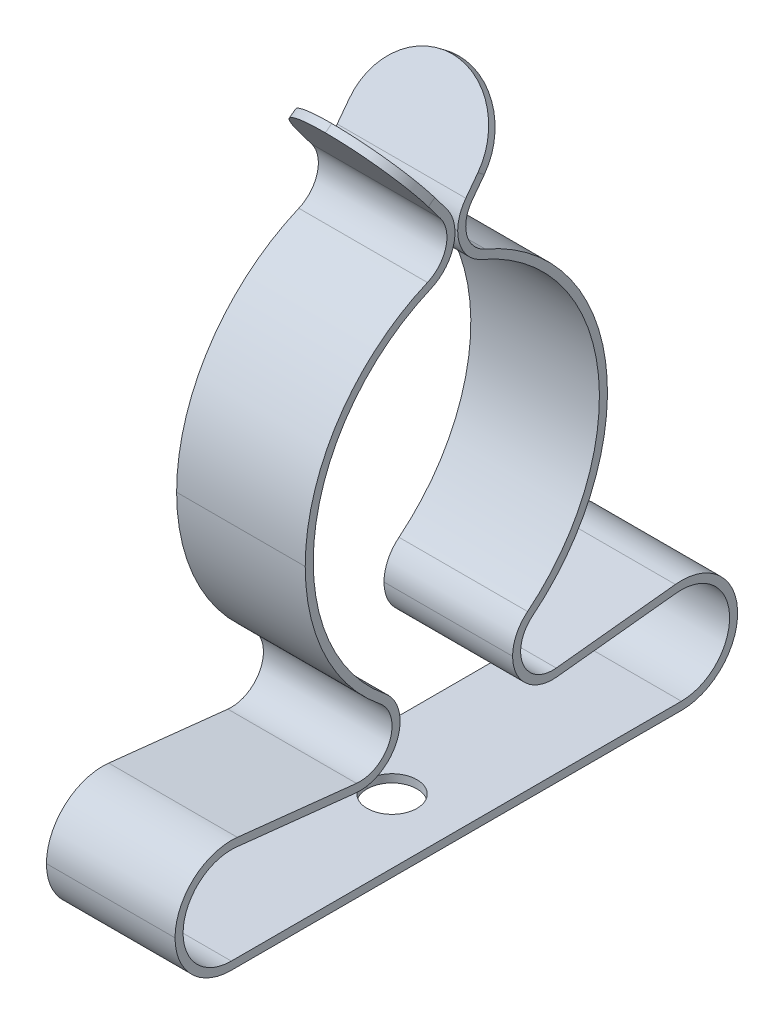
ISO-10303-21;
HEADER;
FILE_DESCRIPTION(('STEP AP214'),'2;1');
FILE_NAME('part.step','',(''),(''),'','','');
FILE_SCHEMA(('AUTOMOTIVE_DESIGN { 1 0 10303 214 1 1 1 1 }'));
ENDSEC;
DATA;
#1=APPLICATION_CONTEXT('core data for automotive mechanical design processes');
#2=APPLICATION_PROTOCOL_DEFINITION('international standard','automotive_design',2000,#1);
#3=PRODUCT_CONTEXT('',#1,'mechanical');
#4=PRODUCT('Part','Part','',(#3));
#5=PRODUCT_RELATED_PRODUCT_CATEGORY('part','',(#4));
#6=PRODUCT_DEFINITION_FORMATION('','',#4);
#7=PRODUCT_DEFINITION_CONTEXT('part definition',#1,'design');
#8=PRODUCT_DEFINITION('design','',#6,#7);
#9=PRODUCT_DEFINITION_SHAPE('','',#8);
#10=(LENGTH_UNIT() NAMED_UNIT(*) SI_UNIT(.MILLI.,.METRE.));
#11=(NAMED_UNIT(*) PLANE_ANGLE_UNIT() SI_UNIT($,.RADIAN.));
#12=(NAMED_UNIT(*) SI_UNIT($,.STERADIAN.) SOLID_ANGLE_UNIT());
#13=UNCERTAINTY_MEASURE_WITH_UNIT(LENGTH_MEASURE(1.E-05),#10,'distance_accuracy_value','');
#14=(GEOMETRIC_REPRESENTATION_CONTEXT(3) GLOBAL_UNCERTAINTY_ASSIGNED_CONTEXT((#13)) GLOBAL_UNIT_ASSIGNED_CONTEXT((#10,
#11,#12)) REPRESENTATION_CONTEXT('',''));
#15=CARTESIAN_POINT('',(0.,0.,0.));
#16=DIRECTION('',(0.,0.,1.));
#17=DIRECTION('',(1.,0.,0.));
#18=AXIS2_PLACEMENT_3D('',#15,#16,#17);
#19=CARTESIAN_POINT('',(0.,43.1009588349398,3.66111084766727));
#20=DIRECTION('',(0.,-0.601889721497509,-0.798579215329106));
#21=DIRECTION('',(0.,0.798579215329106,-0.601889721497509));
#22=AXIS2_PLACEMENT_3D('',#19,#20,#21);
#23=CYLINDRICAL_SURFACE('',#22,4.);
#24=CARTESIAN_POINT('',(0.,44.6056831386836,5.65755888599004));
#25=DIRECTION('',(0.,0.601889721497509,0.798579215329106));
#26=DIRECTION('',(0.,-0.798579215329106,0.601889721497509));
#27=AXIS2_PLACEMENT_3D('',#24,#25,#26);
#28=CIRCLE('',#27,4.);
#29=CARTESIAN_POINT('',(0.,47.8,3.25));
#30=VERTEX_POINT('',#29);
#31=CARTESIAN_POINT('',(-4.,44.6056831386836,5.65755888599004));
#32=VERTEX_POINT('',#31);
#33=EDGE_CURVE('E593',#30,#32,#28,.T.);
#34=ORIENTED_EDGE('',*,*,#33,.F.);
#35=DIRECTION('',(0.,-0.601889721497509,-0.798579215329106));
#36=VECTOR('',#35,1.);
#37=CARTESIAN_POINT('',(0.,47.4990551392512,2.85071039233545));
#38=LINE('',#37,#36);
#39=CARTESIAN_POINT('',(0.,47.4990551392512,2.85071039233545));
#40=VERTEX_POINT('',#39);
#41=EDGE_CURVE('E11',#30,#40,#38,.T.);
#42=ORIENTED_EDGE('',*,*,#41,.T.);
#43=CARTESIAN_POINT('',(0.,44.3047382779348,5.25826927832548));
#44=DIRECTION('',(0.,-0.601889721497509,-0.798579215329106));
#45=DIRECTION('',(0.,-0.798579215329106,0.601889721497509));
#46=AXIS2_PLACEMENT_3D('',#43,#44,#45);
#47=CIRCLE('',#46,4.);
#48=CARTESIAN_POINT('',(-4.,44.3047382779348,5.25826927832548));
#49=VERTEX_POINT('',#48);
#50=EDGE_CURVE('E574',#49,#40,#47,.T.);
#51=ORIENTED_EDGE('',*,*,#50,.F.);
#52=DIRECTION('',(0.,-0.601889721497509,-0.798579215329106));
#53=VECTOR('',#52,1.);
#54=CARTESIAN_POINT('',(-4.,43.1009588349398,3.66111084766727));
#55=LINE('',#54,#53);
#56=EDGE_CURVE('E382',#32,#49,#55,.T.);
#57=ORIENTED_EDGE('',*,*,#56,.F.);
#58=EDGE_LOOP('',(#34,#42,#51,#57));
#59=FACE_BOUND('',#58,.T.);
#60=ADVANCED_FACE('F16',(#59),#23,.T.);
#61=CARTESIAN_POINT('',(0.,44.6056831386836,5.65755888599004));
#62=DIRECTION('',(0.,0.601889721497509,0.798579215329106));
#63=DIRECTION('',(0.,-0.798579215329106,0.601889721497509));
#64=AXIS2_PLACEMENT_3D('',#61,#62,#63);
#65=CYLINDRICAL_SURFACE('',#64,4.);
#66=ORIENTED_EDGE('',*,*,#41,.F.);
#67=CARTESIAN_POINT('',(0.,44.6056831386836,5.65755888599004));
#68=DIRECTION('',(0.,0.601889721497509,0.798579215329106));
#69=DIRECTION('',(0.,-0.798579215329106,0.601889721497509));
#70=AXIS2_PLACEMENT_3D('',#67,#68,#69);
#71=CIRCLE('',#70,4.);
#72=CARTESIAN_POINT('',(4.,44.6056831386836,5.65755888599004));
#73=VERTEX_POINT('',#72);
#74=EDGE_CURVE('E585',#73,#30,#71,.T.);
#75=ORIENTED_EDGE('',*,*,#74,.F.);
#76=DIRECTION('',(0.,0.601889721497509,0.798579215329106));
#77=VECTOR('',#76,1.);
#78=CARTESIAN_POINT('',(4.,44.6056831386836,5.65755888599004));
#79=LINE('',#78,#77);
#80=CARTESIAN_POINT('',(4.,44.3047382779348,5.25826927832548));
#81=VERTEX_POINT('',#80);
#82=EDGE_CURVE('E365',#81,#73,#79,.T.);
#83=ORIENTED_EDGE('',*,*,#82,.F.);
#84=CARTESIAN_POINT('',(0.,44.3047382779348,5.25826927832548));
#85=DIRECTION('',(0.,-0.601889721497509,-0.798579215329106));
#86=DIRECTION('',(0.,-0.798579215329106,0.601889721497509));
#87=AXIS2_PLACEMENT_3D('',#84,#85,#86);
#88=CIRCLE('',#87,4.);
#89=EDGE_CURVE('E578',#40,#81,#88,.T.);
#90=ORIENTED_EDGE('',*,*,#89,.F.);
#91=EDGE_LOOP('',(#66,#75,#83,#90));
#92=FACE_BOUND('',#91,.T.);
#93=ADVANCED_FACE('F824',(#92),#65,.T.);
#94=CARTESIAN_POINT('',(0.,45.5854400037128,7.04251283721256));
#95=DIRECTION('',(0.,0.601889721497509,-0.798579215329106));
#96=DIRECTION('',(0.,0.798579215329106,0.601889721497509));
#97=AXIS2_PLACEMENT_3D('',#94,#95,#96);
#98=CYLINDRICAL_SURFACE('',#97,4.);
#99=CARTESIAN_POINT('',(0.,44.3047382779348,8.74173072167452));
#100=DIRECTION('',(0.,-0.601889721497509,0.798579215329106));
#101=DIRECTION('',(0.,0.798579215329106,0.601889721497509));
#102=AXIS2_PLACEMENT_3D('',#99,#100,#101);
#103=CIRCLE('',#102,4.);
#104=CARTESIAN_POINT('',(0.,47.4990551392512,11.1492896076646));
#105=VERTEX_POINT('',#104);
#106=CARTESIAN_POINT('',(-4.,44.3047382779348,8.74173072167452));
#107=VERTEX_POINT('',#106);
#108=EDGE_CURVE('E470',#105,#107,#103,.T.);
#109=ORIENTED_EDGE('',*,*,#108,.F.);
#110=DIRECTION('',(0.,0.601889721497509,-0.798579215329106));
#111=VECTOR('',#110,1.);
#112=CARTESIAN_POINT('',(0.,47.8,10.75));
#113=LINE('',#112,#111);
#114=CARTESIAN_POINT('',(0.,47.8,10.75));
#115=VERTEX_POINT('',#114);
#116=EDGE_CURVE('E19',#105,#115,#113,.T.);
#117=ORIENTED_EDGE('',*,*,#116,.T.);
#118=CARTESIAN_POINT('',(0.,44.6056831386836,8.34244111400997));
#119=DIRECTION('',(0.,0.601889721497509,-0.798579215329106));
#120=DIRECTION('',(0.,0.798579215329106,0.601889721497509));
#121=AXIS2_PLACEMENT_3D('',#118,#119,#120);
#122=CIRCLE('',#121,4.);
#123=CARTESIAN_POINT('',(-4.,44.6056831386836,8.34244111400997));
#124=VERTEX_POINT('',#123);
#125=EDGE_CURVE('E607',#124,#115,#122,.T.);
#126=ORIENTED_EDGE('',*,*,#125,.F.);
#127=DIRECTION('',(0.,0.601889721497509,-0.798579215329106));
#128=VECTOR('',#127,1.);
#129=CARTESIAN_POINT('',(-4.,45.5854400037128,7.04251283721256));
#130=LINE('',#129,#128);
#131=EDGE_CURVE('E373',#107,#124,#130,.T.);
#132=ORIENTED_EDGE('',*,*,#131,.F.);
#133=EDGE_LOOP('',(#109,#117,#126,#132));
#134=FACE_BOUND('',#133,.T.);
#135=ADVANCED_FACE('F835',(#134),#98,.T.);
#136=CARTESIAN_POINT('',(0.,44.3047382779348,8.74173072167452));
#137=DIRECTION('',(0.,-0.601889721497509,0.798579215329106));
#138=DIRECTION('',(0.,-0.798579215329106,-0.601889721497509));
#139=AXIS2_PLACEMENT_3D('',#136,#137,#138);
#140=CYLINDRICAL_SURFACE('',#139,4.);
#141=ORIENTED_EDGE('',*,*,#116,.F.);
#142=CARTESIAN_POINT('',(0.,44.3047382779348,8.74173072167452));
#143=DIRECTION('',(0.,-0.601889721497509,0.798579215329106));
#144=DIRECTION('',(0.,0.798579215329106,0.601889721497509));
#145=AXIS2_PLACEMENT_3D('',#142,#143,#144);
#146=CIRCLE('',#145,4.);
#147=CARTESIAN_POINT('',(4.,44.3047382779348,8.74173072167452));
#148=VERTEX_POINT('',#147);
#149=EDGE_CURVE('E464',#148,#105,#146,.T.);
#150=ORIENTED_EDGE('',*,*,#149,.F.);
#151=DIRECTION('',(0.,-0.601889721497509,0.798579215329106));
#152=VECTOR('',#151,1.);
#153=CARTESIAN_POINT('',(4.,44.3047382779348,8.74173072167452));
#154=LINE('',#153,#152);
#155=CARTESIAN_POINT('',(4.,44.6056831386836,8.34244111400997));
#156=VERTEX_POINT('',#155);
#157=EDGE_CURVE('E363',#156,#148,#154,.T.);
#158=ORIENTED_EDGE('',*,*,#157,.F.);
#159=CARTESIAN_POINT('',(0.,44.6056831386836,8.34244111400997));
#160=DIRECTION('',(0.,0.601889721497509,-0.798579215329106));
#161=DIRECTION('',(0.,0.798579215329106,0.601889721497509));
#162=AXIS2_PLACEMENT_3D('',#159,#160,#161);
#163=CIRCLE('',#162,4.);
#164=EDGE_CURVE('E465',#115,#156,#163,.T.);
#165=ORIENTED_EDGE('',*,*,#164,.F.);
#166=EDGE_LOOP('',(#141,#150,#158,#165));
#167=FACE_BOUND('',#166,.T.);
#168=ADVANCED_FACE('F840',(#167),#140,.T.);
#169=CARTESIAN_POINT('',(0.,14.1840620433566,7.));
#170=DIRECTION('',(0.,-1.,0.));
#171=DIRECTION('',(-1.,0.,0.));
#172=AXIS2_PLACEMENT_3D('',#169,#170,#171);
#173=CYLINDRICAL_SURFACE('',#172,1.55);
#174=DIRECTION('',(0.,-1.,0.));
#175=VECTOR('',#174,1.);
#176=CARTESIAN_POINT('',(1.55000000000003,14.1840620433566,7.));
#177=LINE('',#176,#175);
#178=CARTESIAN_POINT('',(1.55000000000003,9.8,7.));
#179=VERTEX_POINT('',#178);
#180=CARTESIAN_POINT('',(1.55000000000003,9.3,7.));
#181=VERTEX_POINT('',#180);
#182=EDGE_CURVE('E791',#179,#181,#177,.T.);
#183=ORIENTED_EDGE('',*,*,#182,.F.);
#184=CARTESIAN_POINT('',(0.,9.8,7.));
#185=DIRECTION('',(0.,-1.,0.));
#186=DIRECTION('',(1.,0.,0.));
#187=AXIS2_PLACEMENT_3D('',#184,#185,#186);
#188=CIRCLE('',#187,1.55);
#189=CARTESIAN_POINT('',(-1.54999999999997,9.8,7.));
#190=VERTEX_POINT('',#189);
#191=EDGE_CURVE('E425',#190,#179,#188,.T.);
#192=ORIENTED_EDGE('',*,*,#191,.F.);
#193=DIRECTION('',(0.,-1.,0.));
#194=VECTOR('',#193,1.);
#195=CARTESIAN_POINT('',(-1.54999999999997,14.1840620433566,7.));
#196=LINE('',#195,#194);
#197=CARTESIAN_POINT('',(-1.54999999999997,9.3,7.));
#198=VERTEX_POINT('',#197);
#199=EDGE_CURVE('E774',#190,#198,#196,.T.);
#200=ORIENTED_EDGE('',*,*,#199,.T.);
#201=CARTESIAN_POINT('',(0.,9.3,7.));
#202=DIRECTION('',(0.,-1.,0.));
#203=DIRECTION('',(-1.,0.,0.));
#204=AXIS2_PLACEMENT_3D('',#201,#202,#203);
#205=CIRCLE('',#204,1.55);
#206=EDGE_CURVE('E453',#198,#181,#205,.T.);
#207=ORIENTED_EDGE('',*,*,#206,.T.);
#208=EDGE_LOOP('',(#183,#192,#200,#207));
#209=FACE_BOUND('',#208,.T.);
#210=ADVANCED_FACE('F876',(#209),#173,.F.);
#211=CARTESIAN_POINT('',(-4.,42.1,4.41553423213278));
#212=DIRECTION('',(-1.,0.,0.));
#213=DIRECTION('',(0.,-1.,0.));
#214=AXIS2_PLACEMENT_3D('',#211,#212,#213);
#215=PLANE('',#214);
#216=DIRECTION('',(0.,-0.798579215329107,-0.601889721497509));
#217=VECTOR('',#216,1.);
#218=CARTESIAN_POINT('',(-4.,43.303779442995,7.98730733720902));
#219=LINE('',#218,#217);
#220=CARTESIAN_POINT('',(-4.,43.303779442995,7.98730733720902));
#221=VERTEX_POINT('',#220);
#222=EDGE_CURVE('E466',#107,#221,#219,.T.);
#223=ORIENTED_EDGE('',*,*,#222,.F.);
#224=ORIENTED_EDGE('',*,*,#131,.T.);
#225=DIRECTION('',(0.,-0.798579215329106,-0.601889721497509));
#226=VECTOR('',#225,1.);
#227=CARTESIAN_POINT('',(-4.,43.6047243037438,7.58801772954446));
#228=LINE('',#227,#226);
#229=CARTESIAN_POINT('',(-4.,43.6047243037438,7.58801772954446));
#230=VERTEX_POINT('',#229);
#231=EDGE_CURVE('E461',#124,#230,#228,.T.);
#232=ORIENTED_EDGE('',*,*,#231,.T.);
#233=CARTESIAN_POINT('',(-4.,42.1,9.58446576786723));
#234=DIRECTION('',(-1.,0.,0.));
#235=DIRECTION('',(0.,0.,-1.));
#236=AXIS2_PLACEMENT_3D('',#233,#234,#235);
#237=CIRCLE('',#236,2.5);
#238=CARTESIAN_POINT('',(-4.,39.8,8.60466987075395));
#239=VERTEX_POINT('',#238);
#240=EDGE_CURVE('E444',#230,#239,#237,.T.);
#241=ORIENTED_EDGE('',*,*,#240,.T.);
#242=CARTESIAN_POINT('',(-4.,28.76,3.90164956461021));
#243=DIRECTION('',(1.,0.,0.));
#244=DIRECTION('',(0.,0.,1.));
#245=AXIS2_PLACEMENT_3D('',#242,#243,#244);
#246=CIRCLE('',#245,12.);
#247=CARTESIAN_POINT('',(-4.,28.76,15.9016495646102));
#248=VERTEX_POINT('',#247);
#249=EDGE_CURVE('E687',#239,#248,#246,.T.);
#250=ORIENTED_EDGE('',*,*,#249,.T.);
#251=CARTESIAN_POINT('',(-4.,28.76,3.90164956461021));
#252=DIRECTION('',(1.,0.,0.));
#253=DIRECTION('',(0.,0.,1.));
#254=AXIS2_PLACEMENT_3D('',#251,#252,#253);
#255=CIRCLE('',#254,12.);
#256=CARTESIAN_POINT('',(-4.,19.4163347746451,11.43131889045));
#257=VERTEX_POINT('',#256);
#258=EDGE_CURVE('E441',#248,#257,#255,.T.);
#259=ORIENTED_EDGE('',*,*,#258,.T.);
#260=CARTESIAN_POINT('',(-4.,17.4697378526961,13.));
#261=DIRECTION('',(-1.,0.,0.));
#262=DIRECTION('',(0.,0.,-1.));
#263=AXIS2_PLACEMENT_3D('',#260,#261,#262);
#264=CIRCLE('',#263,2.5);
#265=CARTESIAN_POINT('',(-4.,14.984128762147,13.2678571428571));
#266=VERTEX_POINT('',#265);
#267=EDGE_CURVE('E440',#257,#266,#264,.T.);
#268=ORIENTED_EDGE('',*,*,#267,.T.);
#269=DIRECTION('',(0.,0.107142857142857,0.994243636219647));
#270=VECTOR('',#269,1.);
#271=CARTESIAN_POINT('',(-4.,15.7827309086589,20.6785714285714));
#272=LINE('',#271,#270);
#273=CARTESIAN_POINT('',(-4.,15.7827309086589,20.6785714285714));
#274=VERTEX_POINT('',#273);
#275=EDGE_CURVE('E428',#266,#274,#272,.T.);
#276=ORIENTED_EDGE('',*,*,#275,.T.);
#277=CARTESIAN_POINT('',(-4.,12.8,21.));
#278=DIRECTION('',(1.,0.,0.));
#279=DIRECTION('',(0.,0.,1.));
#280=AXIS2_PLACEMENT_3D('',#277,#278,#279);
#281=CIRCLE('',#280,3.);
#282=CARTESIAN_POINT('',(-4.,12.8,24.));
#283=VERTEX_POINT('',#282);
#284=EDGE_CURVE('E656',#274,#283,#281,.T.);
#285=ORIENTED_EDGE('',*,*,#284,.T.);
#286=CARTESIAN_POINT('',(-4.,12.8,21.));
#287=DIRECTION('',(1.,0.,0.));
#288=DIRECTION('',(0.,0.,1.));
#289=AXIS2_PLACEMENT_3D('',#286,#287,#288);
#290=CIRCLE('',#289,3.);
#291=CARTESIAN_POINT('',(-4.,9.8,21.));
#292=VERTEX_POINT('',#291);
#293=EDGE_CURVE('E424',#283,#292,#290,.T.);
#294=ORIENTED_EDGE('',*,*,#293,.T.);
#295=DIRECTION('',(0.,0.,-1.));
#296=VECTOR('',#295,1.);
#297=CARTESIAN_POINT('',(-4.,9.8,21.));
#298=LINE('',#297,#296);
#299=CARTESIAN_POINT('',(-4.,9.8,-7.));
#300=VERTEX_POINT('',#299);
#301=EDGE_CURVE('E517',#292,#300,#298,.T.);
#302=ORIENTED_EDGE('',*,*,#301,.T.);
#303=CARTESIAN_POINT('',(-4.,12.8,-7.));
#304=DIRECTION('',(1.,0.,0.));
#305=DIRECTION('',(0.,0.,-1.));
#306=AXIS2_PLACEMENT_3D('',#303,#304,#305);
#307=CIRCLE('',#306,3.);
#308=CARTESIAN_POINT('',(-4.,15.7827309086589,-6.67857142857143));
#309=VERTEX_POINT('',#308);
#310=EDGE_CURVE('E500',#300,#309,#307,.T.);
#311=ORIENTED_EDGE('',*,*,#310,.T.);
#312=DIRECTION('',(0.,-0.107142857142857,0.994243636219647));
#313=VECTOR('',#312,1.);
#314=CARTESIAN_POINT('',(-4.,15.7827309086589,-6.67857142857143));
#315=LINE('',#314,#313);
#316=CARTESIAN_POINT('',(-4.,14.984128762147,0.732142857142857));
#317=VERTEX_POINT('',#316);
#318=EDGE_CURVE('E493',#309,#317,#315,.T.);
#319=ORIENTED_EDGE('',*,*,#318,.T.);
#320=CARTESIAN_POINT('',(-4.,17.4697378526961,1.));
#321=DIRECTION('',(-1.,0.,0.));
#322=DIRECTION('',(0.,0.,1.));
#323=AXIS2_PLACEMENT_3D('',#320,#321,#322);
#324=CIRCLE('',#323,2.5);
#325=CARTESIAN_POINT('',(-4.,17.4697378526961,3.5));
#326=VERTEX_POINT('',#325);
#327=EDGE_CURVE('E540',#317,#326,#324,.T.);
#328=ORIENTED_EDGE('',*,*,#327,.T.);
#329=CARTESIAN_POINT('',(-4.,17.4697378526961,1.));
#330=DIRECTION('',(-1.,0.,0.));
#331=DIRECTION('',(0.,0.,1.));
#332=AXIS2_PLACEMENT_3D('',#329,#330,#331);
#333=CIRCLE('',#332,2.5);
#334=CARTESIAN_POINT('',(-4.,19.4163347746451,2.56868110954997));
#335=VERTEX_POINT('',#334);
#336=EDGE_CURVE('E490',#326,#335,#333,.T.);
#337=ORIENTED_EDGE('',*,*,#336,.T.);
#338=CARTESIAN_POINT('',(-4.,28.76,10.0983504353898));
#339=DIRECTION('',(1.,0.,0.));
#340=DIRECTION('',(0.,0.,-1.));
#341=AXIS2_PLACEMENT_3D('',#338,#339,#340);
#342=CIRCLE('',#341,12.);
#343=CARTESIAN_POINT('',(-4.,39.8,5.39533012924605));
#344=VERTEX_POINT('',#343);
#345=EDGE_CURVE('E613',#335,#344,#342,.T.);
#346=ORIENTED_EDGE('',*,*,#345,.T.);
#347=CARTESIAN_POINT('',(-4.,42.1,4.41553423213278));
#348=DIRECTION('',(-1.,0.,0.));
#349=DIRECTION('',(0.,0.,1.));
#350=AXIS2_PLACEMENT_3D('',#347,#348,#349);
#351=CIRCLE('',#350,2.5);
#352=CARTESIAN_POINT('',(-4.,42.1,6.91553423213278));
#353=VERTEX_POINT('',#352);
#354=EDGE_CURVE('E562',#344,#353,#351,.T.);
#355=ORIENTED_EDGE('',*,*,#354,.T.);
#356=CARTESIAN_POINT('',(-4.,42.1,4.41553423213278));
#357=DIRECTION('',(-1.,0.,0.));
#358=DIRECTION('',(0.,0.,1.));
#359=AXIS2_PLACEMENT_3D('',#356,#357,#358);
#360=CIRCLE('',#359,2.5);
#361=CARTESIAN_POINT('',(-4.,43.6047243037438,6.41198227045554));
#362=VERTEX_POINT('',#361);
#363=EDGE_CURVE('E606',#353,#362,#360,.T.);
#364=ORIENTED_EDGE('',*,*,#363,.T.);
#365=DIRECTION('',(0.,0.798579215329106,-0.601889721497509));
#366=VECTOR('',#365,1.);
#367=CARTESIAN_POINT('',(-4.,43.6047243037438,6.41198227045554));
#368=LINE('',#367,#366);
#369=EDGE_CURVE('E597',#362,#32,#368,.T.);
#370=ORIENTED_EDGE('',*,*,#369,.T.);
#371=ORIENTED_EDGE('',*,*,#56,.T.);
#372=DIRECTION('',(0.,0.798579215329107,-0.601889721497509));
#373=VECTOR('',#372,1.);
#374=CARTESIAN_POINT('',(-4.,43.303779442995,6.01269266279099));
#375=LINE('',#374,#373);
#376=CARTESIAN_POINT('',(-4.,43.303779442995,6.01269266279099));
#377=VERTEX_POINT('',#376);
#378=EDGE_CURVE('E570',#377,#49,#375,.T.);
#379=ORIENTED_EDGE('',*,*,#378,.F.);
#380=CARTESIAN_POINT('',(-4.,42.1,4.41553423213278));
#381=DIRECTION('',(-1.,0.,0.));
#382=DIRECTION('',(0.,0.,-1.));
#383=AXIS2_PLACEMENT_3D('',#380,#381,#382);
#384=CIRCLE('',#383,2.);
#385=CARTESIAN_POINT('',(-4.,42.1,6.41553423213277));
#386=VERTEX_POINT('',#385);
#387=EDGE_CURVE('E752',#386,#377,#384,.T.);
#388=ORIENTED_EDGE('',*,*,#387,.F.);
#389=CARTESIAN_POINT('',(-4.,42.1,4.41553423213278));
#390=DIRECTION('',(-1.,0.,0.));
#391=DIRECTION('',(0.,0.,-1.));
#392=AXIS2_PLACEMENT_3D('',#389,#390,#391);
#393=CIRCLE('',#392,2.);
#394=CARTESIAN_POINT('',(-4.,40.26,5.19937094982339));
#395=VERTEX_POINT('',#394);
#396=EDGE_CURVE('E360',#395,#386,#393,.T.);
#397=ORIENTED_EDGE('',*,*,#396,.F.);
#398=CARTESIAN_POINT('',(-4.,28.76,10.0983504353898));
#399=DIRECTION('',(1.,0.,0.));
#400=DIRECTION('',(0.,0.,-1.));
#401=AXIS2_PLACEMENT_3D('',#398,#399,#400);
#402=CIRCLE('',#401,12.5);
#403=CARTESIAN_POINT('',(-4.,19.0270153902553,2.25494488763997));
#404=VERTEX_POINT('',#403);
#405=EDGE_CURVE('E328',#404,#395,#402,.T.);
#406=ORIENTED_EDGE('',*,*,#405,.F.);
#407=CARTESIAN_POINT('',(-4.,17.4697378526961,1.));
#408=DIRECTION('',(-1.,0.,0.));
#409=DIRECTION('',(0.,0.,-1.));
#410=AXIS2_PLACEMENT_3D('',#407,#408,#409);
#411=CIRCLE('',#410,2.);
#412=CARTESIAN_POINT('',(-4.,17.4697378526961,3.));
#413=VERTEX_POINT('',#412);
#414=EDGE_CURVE('E323',#413,#404,#411,.T.);
#415=ORIENTED_EDGE('',*,*,#414,.F.);
#416=CARTESIAN_POINT('',(-4.,17.4697378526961,1.));
#417=DIRECTION('',(-1.,0.,0.));
#418=DIRECTION('',(0.,0.,-1.));
#419=AXIS2_PLACEMENT_3D('',#416,#417,#418);
#420=CIRCLE('',#419,2.);
#421=CARTESIAN_POINT('',(-4.,15.4812505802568,0.785714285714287));
#422=VERTEX_POINT('',#421);
#423=EDGE_CURVE('E316',#422,#413,#420,.T.);
#424=ORIENTED_EDGE('',*,*,#423,.F.);
#425=DIRECTION('',(0.,-0.107142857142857,0.994243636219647));
#426=VECTOR('',#425,1.);
#427=CARTESIAN_POINT('',(-4.,16.2798527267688,-6.625));
#428=LINE('',#427,#426);
#429=CARTESIAN_POINT('',(-4.,16.2798527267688,-6.625));
#430=VERTEX_POINT('',#429);
#431=EDGE_CURVE('E321',#430,#422,#428,.T.);
#432=ORIENTED_EDGE('',*,*,#431,.F.);
#433=CARTESIAN_POINT('',(-4.,12.8,-7.));
#434=DIRECTION('',(1.,0.,0.));
#435=DIRECTION('',(0.,0.,-1.));
#436=AXIS2_PLACEMENT_3D('',#433,#434,#435);
#437=CIRCLE('',#436,3.5);
#438=CARTESIAN_POINT('',(-4.,9.3,-7.));
#439=VERTEX_POINT('',#438);
#440=EDGE_CURVE('E457',#439,#430,#437,.T.);
#441=ORIENTED_EDGE('',*,*,#440,.F.);
#442=DIRECTION('',(0.,0.,-1.));
#443=VECTOR('',#442,1.);
#444=CARTESIAN_POINT('',(-4.,9.3,21.));
#445=LINE('',#444,#443);
#446=CARTESIAN_POINT('',(-4.,9.3,21.));
#447=VERTEX_POINT('',#446);
#448=EDGE_CURVE('E437',#447,#439,#445,.T.);
#449=ORIENTED_EDGE('',*,*,#448,.F.);
#450=CARTESIAN_POINT('',(-4.,12.8,21.));
#451=DIRECTION('',(1.,0.,0.));
#452=DIRECTION('',(0.,0.,-1.));
#453=AXIS2_PLACEMENT_3D('',#450,#451,#452);
#454=CIRCLE('',#453,3.5);
#455=CARTESIAN_POINT('',(-4.,12.8,24.5));
#456=VERTEX_POINT('',#455);
#457=EDGE_CURVE('E724',#456,#447,#454,.T.);
#458=ORIENTED_EDGE('',*,*,#457,.F.);
#459=CARTESIAN_POINT('',(-4.,12.8,21.));
#460=DIRECTION('',(1.,0.,0.));
#461=DIRECTION('',(0.,0.,-1.));
#462=AXIS2_PLACEMENT_3D('',#459,#460,#461);
#463=CIRCLE('',#462,3.5);
#464=CARTESIAN_POINT('',(-4.,16.2798527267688,20.625));
#465=VERTEX_POINT('',#464);
#466=EDGE_CURVE('E434',#465,#456,#463,.T.);
#467=ORIENTED_EDGE('',*,*,#466,.F.);
#468=DIRECTION('',(0.,0.107142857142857,0.994243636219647));
#469=VECTOR('',#468,1.);
#470=CARTESIAN_POINT('',(-4.,16.2798527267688,20.625));
#471=LINE('',#470,#469);
#472=CARTESIAN_POINT('',(-4.,15.4812505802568,13.2142857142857));
#473=VERTEX_POINT('',#472);
#474=EDGE_CURVE('E398',#473,#465,#471,.T.);
#475=ORIENTED_EDGE('',*,*,#474,.F.);
#476=CARTESIAN_POINT('',(-4.,17.4697378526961,13.));
#477=DIRECTION('',(-1.,0.,0.));
#478=DIRECTION('',(0.,0.,-1.));
#479=AXIS2_PLACEMENT_3D('',#476,#477,#478);
#480=CIRCLE('',#479,2.);
#481=CARTESIAN_POINT('',(-4.,19.0270153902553,11.74505511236));
#482=VERTEX_POINT('',#481);
#483=EDGE_CURVE('E393',#482,#473,#480,.T.);
#484=ORIENTED_EDGE('',*,*,#483,.F.);
#485=CARTESIAN_POINT('',(-4.,28.76,3.90164956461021));
#486=DIRECTION('',(1.,0.,0.));
#487=DIRECTION('',(0.,0.,-1.));
#488=AXIS2_PLACEMENT_3D('',#485,#486,#487);
#489=CIRCLE('',#488,12.5);
#490=CARTESIAN_POINT('',(-4.,28.76,16.4016495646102));
#491=VERTEX_POINT('',#490);
#492=EDGE_CURVE('E708',#491,#482,#489,.T.);
#493=ORIENTED_EDGE('',*,*,#492,.F.);
#494=CARTESIAN_POINT('',(-4.,28.76,3.90164956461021));
#495=DIRECTION('',(1.,0.,0.));
#496=DIRECTION('',(0.,0.,-1.));
#497=AXIS2_PLACEMENT_3D('',#494,#495,#496);
#498=CIRCLE('',#497,12.5);
#499=CARTESIAN_POINT('',(-4.,40.26,8.8006290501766));
#500=VERTEX_POINT('',#499);
#501=EDGE_CURVE('E390',#500,#491,#498,.T.);
#502=ORIENTED_EDGE('',*,*,#501,.F.);
#503=CARTESIAN_POINT('',(-4.,42.1,9.58446576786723));
#504=DIRECTION('',(-1.,0.,0.));
#505=DIRECTION('',(0.,0.,-1.));
#506=AXIS2_PLACEMENT_3D('',#503,#504,#505);
#507=CIRCLE('',#506,2.);
#508=EDGE_CURVE('E386',#221,#500,#507,.T.);
#509=ORIENTED_EDGE('',*,*,#508,.F.);
#510=EDGE_LOOP('',(#223,#224,#232,#241,#250,#259,#268,#276,#285,#294,#302,#311,#319,#328,#337,
#346,#355,#364,#370,#371,#379,#388,#397,#406,#415,#424,#432,#441,#449,#458,#467,#475,#484,#493,
#502,#509));
#511=FACE_BOUND('',#510,.T.);
#512=ADVANCED_FACE('F319',(#511),#215,.T.);
#513=CARTESIAN_POINT('',(4.,42.1,4.41553423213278));
#514=DIRECTION('',(-1.,0.,0.));
#515=DIRECTION('',(0.,-1.,0.));
#516=AXIS2_PLACEMENT_3D('',#513,#514,#515);
#517=PLANE('',#516);
#518=DIRECTION('',(0.,-0.798579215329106,-0.601889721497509));
#519=VECTOR('',#518,1.);
#520=CARTESIAN_POINT('',(4.,43.6047243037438,7.58801772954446));
#521=LINE('',#520,#519);
#522=CARTESIAN_POINT('',(4.,43.6047243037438,7.58801772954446));
#523=VERTEX_POINT('',#522);
#524=EDGE_CURVE('E462',#156,#523,#521,.T.);
#525=ORIENTED_EDGE('',*,*,#524,.F.);
#526=ORIENTED_EDGE('',*,*,#157,.T.);
#527=DIRECTION('',(0.,-0.798579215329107,-0.601889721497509));
#528=VECTOR('',#527,1.);
#529=CARTESIAN_POINT('',(4.,43.303779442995,7.98730733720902));
#530=LINE('',#529,#528);
#531=CARTESIAN_POINT('',(4.,43.303779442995,7.98730733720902));
#532=VERTEX_POINT('',#531);
#533=EDGE_CURVE('E477',#148,#532,#530,.T.);
#534=ORIENTED_EDGE('',*,*,#533,.T.);
#535=CARTESIAN_POINT('',(4.,42.1,9.58446576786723));
#536=DIRECTION('',(-1.,0.,0.));
#537=DIRECTION('',(0.,0.,-1.));
#538=AXIS2_PLACEMENT_3D('',#535,#536,#537);
#539=CIRCLE('',#538,2.);
#540=CARTESIAN_POINT('',(4.,40.26,8.8006290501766));
#541=VERTEX_POINT('',#540);
#542=EDGE_CURVE('E391',#532,#541,#539,.T.);
#543=ORIENTED_EDGE('',*,*,#542,.T.);
#544=CARTESIAN_POINT('',(4.,28.76,3.90164956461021));
#545=DIRECTION('',(1.,0.,0.));
#546=DIRECTION('',(0.,0.,-1.));
#547=AXIS2_PLACEMENT_3D('',#544,#545,#546);
#548=CIRCLE('',#547,12.5);
#549=CARTESIAN_POINT('',(4.,28.76,16.4016495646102));
#550=VERTEX_POINT('',#549);
#551=EDGE_CURVE('E388',#541,#550,#548,.T.);
#552=ORIENTED_EDGE('',*,*,#551,.T.);
#553=CARTESIAN_POINT('',(4.,28.76,3.90164956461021));
#554=DIRECTION('',(1.,0.,0.));
#555=DIRECTION('',(0.,0.,-1.));
#556=AXIS2_PLACEMENT_3D('',#553,#554,#555);
#557=CIRCLE('',#556,12.5);
#558=CARTESIAN_POINT('',(4.,19.0270153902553,11.74505511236));
#559=VERTEX_POINT('',#558);
#560=EDGE_CURVE('E716',#550,#559,#557,.T.);
#561=ORIENTED_EDGE('',*,*,#560,.T.);
#562=CARTESIAN_POINT('',(4.,17.4697378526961,13.));
#563=DIRECTION('',(-1.,0.,0.));
#564=DIRECTION('',(0.,0.,-1.));
#565=AXIS2_PLACEMENT_3D('',#562,#563,#564);
#566=CIRCLE('',#565,2.);
#567=CARTESIAN_POINT('',(4.,15.4812505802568,13.2142857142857));
#568=VERTEX_POINT('',#567);
#569=EDGE_CURVE('E407',#559,#568,#566,.T.);
#570=ORIENTED_EDGE('',*,*,#569,.T.);
#571=DIRECTION('',(0.,0.107142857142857,0.994243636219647));
#572=VECTOR('',#571,1.);
#573=CARTESIAN_POINT('',(4.,16.2798527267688,20.625));
#574=LINE('',#573,#572);
#575=CARTESIAN_POINT('',(4.,16.2798527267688,20.625));
#576=VERTEX_POINT('',#575);
#577=EDGE_CURVE('E397',#568,#576,#574,.T.);
#578=ORIENTED_EDGE('',*,*,#577,.T.);
#579=CARTESIAN_POINT('',(4.,12.8,21.));
#580=DIRECTION('',(1.,0.,0.));
#581=DIRECTION('',(0.,0.,-1.));
#582=AXIS2_PLACEMENT_3D('',#579,#580,#581);
#583=CIRCLE('',#582,3.5);
#584=CARTESIAN_POINT('',(4.,12.8,24.5));
#585=VERTEX_POINT('',#584);
#586=EDGE_CURVE('E349',#576,#585,#583,.T.);
#587=ORIENTED_EDGE('',*,*,#586,.T.);
#588=CARTESIAN_POINT('',(4.,12.8,21.));
#589=DIRECTION('',(1.,0.,0.));
#590=DIRECTION('',(0.,0.,-1.));
#591=AXIS2_PLACEMENT_3D('',#588,#589,#590);
#592=CIRCLE('',#591,3.5);
#593=CARTESIAN_POINT('',(4.,9.3,21.));
#594=VERTEX_POINT('',#593);
#595=EDGE_CURVE('E727',#585,#594,#592,.T.);
#596=ORIENTED_EDGE('',*,*,#595,.T.);
#597=DIRECTION('',(0.,0.,-1.));
#598=VECTOR('',#597,1.);
#599=CARTESIAN_POINT('',(4.,9.3,21.));
#600=LINE('',#599,#598);
#601=CARTESIAN_POINT('',(4.,9.3,-7.));
#602=VERTEX_POINT('',#601);
#603=EDGE_CURVE('E458',#594,#602,#600,.T.);
#604=ORIENTED_EDGE('',*,*,#603,.T.);
#605=CARTESIAN_POINT('',(4.,12.8,-7.));
#606=DIRECTION('',(1.,0.,0.));
#607=DIRECTION('',(0.,0.,-1.));
#608=AXIS2_PLACEMENT_3D('',#605,#606,#607);
#609=CIRCLE('',#608,3.5);
#610=CARTESIAN_POINT('',(4.,16.2798527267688,-6.625));
#611=VERTEX_POINT('',#610);
#612=EDGE_CURVE('E340',#602,#611,#609,.T.);
#613=ORIENTED_EDGE('',*,*,#612,.T.);
#614=DIRECTION('',(0.,-0.107142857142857,0.994243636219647));
#615=VECTOR('',#614,1.);
#616=CARTESIAN_POINT('',(4.,16.2798527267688,-6.625));
#617=LINE('',#616,#615);
#618=CARTESIAN_POINT('',(4.,15.4812505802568,0.785714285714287));
#619=VERTEX_POINT('',#618);
#620=EDGE_CURVE('E309',#611,#619,#617,.T.);
#621=ORIENTED_EDGE('',*,*,#620,.T.);
#622=CARTESIAN_POINT('',(4.,17.4697378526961,1.));
#623=DIRECTION('',(-1.,0.,0.));
#624=DIRECTION('',(0.,0.,-1.));
#625=AXIS2_PLACEMENT_3D('',#622,#623,#624);
#626=CIRCLE('',#625,2.);
#627=CARTESIAN_POINT('',(4.,17.4697378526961,3.));
#628=VERTEX_POINT('',#627);
#629=EDGE_CURVE('E329',#619,#628,#626,.T.);
#630=ORIENTED_EDGE('',*,*,#629,.T.);
#631=CARTESIAN_POINT('',(4.,17.4697378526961,1.));
#632=DIRECTION('',(-1.,0.,0.));
#633=DIRECTION('',(0.,0.,-1.));
#634=AXIS2_PLACEMENT_3D('',#631,#632,#633);
#635=CIRCLE('',#634,2.);
#636=CARTESIAN_POINT('',(4.,19.0270153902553,2.25494488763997));
#637=VERTEX_POINT('',#636);
#638=EDGE_CURVE('E743',#628,#637,#635,.T.);
#639=ORIENTED_EDGE('',*,*,#638,.T.);
#640=CARTESIAN_POINT('',(4.,28.76,10.0983504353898));
#641=DIRECTION('',(1.,0.,0.));
#642=DIRECTION('',(0.,0.,-1.));
#643=AXIS2_PLACEMENT_3D('',#640,#641,#642);
#644=CIRCLE('',#643,12.5);
#645=CARTESIAN_POINT('',(4.,40.26,5.19937094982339));
#646=VERTEX_POINT('',#645);
#647=EDGE_CURVE('E357',#637,#646,#644,.T.);
#648=ORIENTED_EDGE('',*,*,#647,.T.);
#649=CARTESIAN_POINT('',(4.,42.1,4.41553423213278));
#650=DIRECTION('',(-1.,0.,0.));
#651=DIRECTION('',(0.,0.,-1.));
#652=AXIS2_PLACEMENT_3D('',#649,#650,#651);
#653=CIRCLE('',#652,2.);
#654=CARTESIAN_POINT('',(4.,42.1,6.41553423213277));
#655=VERTEX_POINT('',#654);
#656=EDGE_CURVE('E39',#646,#655,#653,.T.);
#657=ORIENTED_EDGE('',*,*,#656,.T.);
#658=CARTESIAN_POINT('',(4.,42.1,4.41553423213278));
#659=DIRECTION('',(-1.,0.,0.));
#660=DIRECTION('',(0.,0.,-1.));
#661=AXIS2_PLACEMENT_3D('',#658,#659,#660);
#662=CIRCLE('',#661,2.);
#663=CARTESIAN_POINT('',(4.,43.303779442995,6.01269266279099));
#664=VERTEX_POINT('',#663);
#665=EDGE_CURVE('E768',#655,#664,#662,.T.);
#666=ORIENTED_EDGE('',*,*,#665,.T.);
#667=DIRECTION('',(0.,0.798579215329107,-0.601889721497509));
#668=VECTOR('',#667,1.);
#669=CARTESIAN_POINT('',(4.,43.303779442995,6.01269266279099));
#670=LINE('',#669,#668);
#671=EDGE_CURVE('E581',#664,#81,#670,.T.);
#672=ORIENTED_EDGE('',*,*,#671,.T.);
#673=ORIENTED_EDGE('',*,*,#82,.T.);
#674=DIRECTION('',(0.,0.798579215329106,-0.601889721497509));
#675=VECTOR('',#674,1.);
#676=CARTESIAN_POINT('',(4.,43.6047243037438,6.41198227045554));
#677=LINE('',#676,#675);
#678=CARTESIAN_POINT('',(4.,43.6047243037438,6.41198227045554));
#679=VERTEX_POINT('',#678);
#680=EDGE_CURVE('E602',#679,#73,#677,.T.);
#681=ORIENTED_EDGE('',*,*,#680,.F.);
#682=CARTESIAN_POINT('',(4.,42.1,4.41553423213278));
#683=DIRECTION('',(-1.,0.,0.));
#684=DIRECTION('',(0.,0.,1.));
#685=AXIS2_PLACEMENT_3D('',#682,#683,#684);
#686=CIRCLE('',#685,2.5);
#687=CARTESIAN_POINT('',(4.,42.1,6.91553423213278));
#688=VERTEX_POINT('',#687);
#689=EDGE_CURVE('E603',#688,#679,#686,.T.);
#690=ORIENTED_EDGE('',*,*,#689,.F.);
#691=CARTESIAN_POINT('',(4.,42.1,4.41553423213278));
#692=DIRECTION('',(-1.,0.,0.));
#693=DIRECTION('',(0.,0.,1.));
#694=AXIS2_PLACEMENT_3D('',#691,#692,#693);
#695=CIRCLE('',#694,2.5);
#696=CARTESIAN_POINT('',(4.,39.8,5.39533012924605));
#697=VERTEX_POINT('',#696);
#698=EDGE_CURVE('E551',#697,#688,#695,.T.);
#699=ORIENTED_EDGE('',*,*,#698,.F.);
#700=CARTESIAN_POINT('',(4.,28.76,10.0983504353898));
#701=DIRECTION('',(1.,0.,0.));
#702=DIRECTION('',(0.,0.,-1.));
#703=AXIS2_PLACEMENT_3D('',#700,#701,#702);
#704=CIRCLE('',#703,12.);
#705=CARTESIAN_POINT('',(4.,19.4163347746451,2.56868110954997));
#706=VERTEX_POINT('',#705);
#707=EDGE_CURVE('E491',#706,#697,#704,.T.);
#708=ORIENTED_EDGE('',*,*,#707,.F.);
#709=CARTESIAN_POINT('',(4.,17.4697378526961,1.));
#710=DIRECTION('',(-1.,0.,0.));
#711=DIRECTION('',(0.,0.,1.));
#712=AXIS2_PLACEMENT_3D('',#709,#710,#711);
#713=CIRCLE('',#712,2.5);
#714=CARTESIAN_POINT('',(4.,17.4697378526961,3.5));
#715=VERTEX_POINT('',#714);
#716=EDGE_CURVE('E489',#715,#706,#713,.T.);
#717=ORIENTED_EDGE('',*,*,#716,.F.);
#718=CARTESIAN_POINT('',(4.,17.4697378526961,1.));
#719=DIRECTION('',(-1.,0.,0.));
#720=DIRECTION('',(0.,0.,1.));
#721=AXIS2_PLACEMENT_3D('',#718,#719,#720);
#722=CIRCLE('',#721,2.5);
#723=CARTESIAN_POINT('',(4.,14.984128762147,0.732142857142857));
#724=VERTEX_POINT('',#723);
#725=EDGE_CURVE('E541',#724,#715,#722,.T.);
#726=ORIENTED_EDGE('',*,*,#725,.F.);
#727=DIRECTION('',(0.,-0.107142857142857,0.994243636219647));
#728=VECTOR('',#727,1.);
#729=CARTESIAN_POINT('',(4.,15.7827309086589,-6.67857142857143));
#730=LINE('',#729,#728);
#731=CARTESIAN_POINT('',(4.,15.7827309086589,-6.67857142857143));
#732=VERTEX_POINT('',#731);
#733=EDGE_CURVE('E497',#732,#724,#730,.T.);
#734=ORIENTED_EDGE('',*,*,#733,.F.);
#735=CARTESIAN_POINT('',(4.,12.8,-7.));
#736=DIRECTION('',(1.,0.,0.));
#737=DIRECTION('',(0.,0.,-1.));
#738=AXIS2_PLACEMENT_3D('',#735,#736,#737);
#739=CIRCLE('',#738,3.);
#740=CARTESIAN_POINT('',(4.,9.8,-7.));
#741=VERTEX_POINT('',#740);
#742=EDGE_CURVE('E514',#741,#732,#739,.T.);
#743=ORIENTED_EDGE('',*,*,#742,.F.);
#744=DIRECTION('',(0.,0.,-1.));
#745=VECTOR('',#744,1.);
#746=CARTESIAN_POINT('',(4.,9.8,21.));
#747=LINE('',#746,#745);
#748=CARTESIAN_POINT('',(4.,9.8,21.));
#749=VERTEX_POINT('',#748);
#750=EDGE_CURVE('E420',#749,#741,#747,.T.);
#751=ORIENTED_EDGE('',*,*,#750,.F.);
#752=CARTESIAN_POINT('',(4.,12.8,21.));
#753=DIRECTION('',(1.,0.,0.));
#754=DIRECTION('',(0.,0.,1.));
#755=AXIS2_PLACEMENT_3D('',#752,#753,#754);
#756=CIRCLE('',#755,3.);
#757=CARTESIAN_POINT('',(4.,12.8,24.));
#758=VERTEX_POINT('',#757);
#759=EDGE_CURVE('E422',#758,#749,#756,.T.);
#760=ORIENTED_EDGE('',*,*,#759,.F.);
#761=CARTESIAN_POINT('',(4.,12.8,21.));
#762=DIRECTION('',(1.,0.,0.));
#763=DIRECTION('',(0.,0.,1.));
#764=AXIS2_PLACEMENT_3D('',#761,#762,#763);
#765=CIRCLE('',#764,3.);
#766=CARTESIAN_POINT('',(4.,15.7827309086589,20.6785714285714));
#767=VERTEX_POINT('',#766);
#768=EDGE_CURVE('E673',#767,#758,#765,.T.);
#769=ORIENTED_EDGE('',*,*,#768,.F.);
#770=DIRECTION('',(0.,0.107142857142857,0.994243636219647));
#771=VECTOR('',#770,1.);
#772=CARTESIAN_POINT('',(4.,15.7827309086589,20.6785714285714));
#773=LINE('',#772,#771);
#774=CARTESIAN_POINT('',(4.,14.984128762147,13.2678571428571));
#775=VERTEX_POINT('',#774);
#776=EDGE_CURVE('E433',#775,#767,#773,.T.);
#777=ORIENTED_EDGE('',*,*,#776,.F.);
#778=CARTESIAN_POINT('',(4.,17.4697378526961,13.));
#779=DIRECTION('',(-1.,0.,0.));
#780=DIRECTION('',(0.,0.,-1.));
#781=AXIS2_PLACEMENT_3D('',#778,#779,#780);
#782=CIRCLE('',#781,2.5);
#783=CARTESIAN_POINT('',(4.,19.4163347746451,11.43131889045));
#784=VERTEX_POINT('',#783);
#785=EDGE_CURVE('E589',#784,#775,#782,.T.);
#786=ORIENTED_EDGE('',*,*,#785,.F.);
#787=CARTESIAN_POINT('',(4.,28.76,3.90164956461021));
#788=DIRECTION('',(1.,0.,0.));
#789=DIRECTION('',(0.,0.,1.));
#790=AXIS2_PLACEMENT_3D('',#787,#788,#789);
#791=CIRCLE('',#790,12.);
#792=CARTESIAN_POINT('',(4.,28.76,15.9016495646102));
#793=VERTEX_POINT('',#792);
#794=EDGE_CURVE('E445',#793,#784,#791,.T.);
#795=ORIENTED_EDGE('',*,*,#794,.F.);
#796=CARTESIAN_POINT('',(4.,28.76,3.90164956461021));
#797=DIRECTION('',(1.,0.,0.));
#798=DIRECTION('',(0.,0.,1.));
#799=AXIS2_PLACEMENT_3D('',#796,#797,#798);
#800=CIRCLE('',#799,12.);
#801=CARTESIAN_POINT('',(4.,39.8,8.60466987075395));
#802=VERTEX_POINT('',#801);
#803=EDGE_CURVE('E698',#802,#793,#800,.T.);
#804=ORIENTED_EDGE('',*,*,#803,.F.);
#805=CARTESIAN_POINT('',(4.,42.1,9.58446576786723));
#806=DIRECTION('',(-1.,0.,0.));
#807=DIRECTION('',(0.,0.,-1.));
#808=AXIS2_PLACEMENT_3D('',#805,#806,#807);
#809=CIRCLE('',#808,2.5);
#810=EDGE_CURVE('E452',#523,#802,#809,.T.);
#811=ORIENTED_EDGE('',*,*,#810,.F.);
#812=EDGE_LOOP('',(#525,#526,#534,#543,#552,#561,#570,#578,#587,#596,#604,#613,#621,#630,#639,
#648,#657,#666,#672,#673,#681,#690,#699,#708,#717,#726,#734,#743,#751,#760,#769,#777,#786,#795,
#804,#811));
#813=FACE_BOUND('',#812,.T.);
#814=ADVANCED_FACE('F631',(#813),#517,.F.);
#815=CARTESIAN_POINT('',(4.,42.1,4.41553423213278));
#816=DIRECTION('',(-1.,0.,0.));
#817=DIRECTION('',(0.,0.,1.));
#818=AXIS2_PLACEMENT_3D('',#815,#816,#817);
#819=CYLINDRICAL_SURFACE('',#818,2.);
#820=DIRECTION('',(-1.,0.,0.));
#821=VECTOR('',#820,1.);
#822=CARTESIAN_POINT('',(4.,42.1,6.41553423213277));
#823=LINE('',#822,#821);
#824=EDGE_CURVE('E759',#655,#386,#823,.T.);
#825=ORIENTED_EDGE('',*,*,#824,.F.);
#826=ORIENTED_EDGE('',*,*,#656,.F.);
#827=DIRECTION('',(-1.,0.,0.));
#828=VECTOR('',#827,1.);
#829=CARTESIAN_POINT('',(4.,40.26,5.19937094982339));
#830=LINE('',#829,#828);
#831=EDGE_CURVE('E354',#646,#395,#830,.T.);
#832=ORIENTED_EDGE('',*,*,#831,.T.);
#833=ORIENTED_EDGE('',*,*,#396,.T.);
#834=EDGE_LOOP('',(#825,#826,#832,#833));
#835=FACE_BOUND('',#834,.T.);
#836=ADVANCED_FACE('F811',(#835),#819,.F.);
#837=CARTESIAN_POINT('',(4.,28.76,10.0983504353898));
#838=DIRECTION('',(-1.,0.,0.));
#839=DIRECTION('',(0.,0.,1.));
#840=AXIS2_PLACEMENT_3D('',#837,#838,#839);
#841=CYLINDRICAL_SURFACE('',#840,12.5);
#842=ORIENTED_EDGE('',*,*,#405,.T.);
#843=ORIENTED_EDGE('',*,*,#831,.F.);
#844=ORIENTED_EDGE('',*,*,#647,.F.);
#845=DIRECTION('',(-1.,0.,0.));
#846=VECTOR('',#845,1.);
#847=CARTESIAN_POINT('',(4.,19.0270153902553,2.25494488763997));
#848=LINE('',#847,#846);
#849=EDGE_CURVE('E732',#637,#404,#848,.T.);
#850=ORIENTED_EDGE('',*,*,#849,.T.);
#851=EDGE_LOOP('',(#842,#843,#844,#850));
#852=FACE_BOUND('',#851,.T.);
#853=ADVANCED_FACE('F866',(#852),#841,.T.);
#854=CARTESIAN_POINT('',(4.,17.4697378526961,1.));
#855=DIRECTION('',(-1.,0.,0.));
#856=DIRECTION('',(0.,0.,1.));
#857=AXIS2_PLACEMENT_3D('',#854,#855,#856);
#858=CYLINDRICAL_SURFACE('',#857,2.);
#859=DIRECTION('',(-1.,0.,0.));
#860=VECTOR('',#859,1.);
#861=CARTESIAN_POINT('',(4.,17.4697378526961,3.));
#862=LINE('',#861,#860);
#863=EDGE_CURVE('E747',#628,#413,#862,.T.);
#864=ORIENTED_EDGE('',*,*,#863,.F.);
#865=ORIENTED_EDGE('',*,*,#629,.F.);
#866=DIRECTION('',(-1.,0.,0.));
#867=VECTOR('',#866,1.);
#868=CARTESIAN_POINT('',(4.,15.4812505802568,0.785714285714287));
#869=LINE('',#868,#867);
#870=EDGE_CURVE('E331',#619,#422,#869,.T.);
#871=ORIENTED_EDGE('',*,*,#870,.T.);
#872=ORIENTED_EDGE('',*,*,#423,.T.);
#873=EDGE_LOOP('',(#864,#865,#871,#872));
#874=FACE_BOUND('',#873,.T.);
#875=ADVANCED_FACE('F332',(#874),#858,.F.);
#876=CARTESIAN_POINT('',(4.,16.2798527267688,-6.625));
#877=DIRECTION('',(0.,-0.994243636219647,-0.107142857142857));
#878=DIRECTION('',(-1.,0.,0.));
#879=AXIS2_PLACEMENT_3D('',#876,#877,#878);
#880=PLANE('',#879);
#881=ORIENTED_EDGE('',*,*,#431,.T.);
#882=ORIENTED_EDGE('',*,*,#870,.F.);
#883=ORIENTED_EDGE('',*,*,#620,.F.);
#884=DIRECTION('',(-1.,0.,0.));
#885=VECTOR('',#884,1.);
#886=CARTESIAN_POINT('',(4.,16.2798527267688,-6.625));
#887=LINE('',#886,#885);
#888=EDGE_CURVE('E337',#611,#430,#887,.T.);
#889=ORIENTED_EDGE('',*,*,#888,.T.);
#890=EDGE_LOOP('',(#881,#882,#883,#889));
#891=FACE_BOUND('',#890,.T.);
#892=ADVANCED_FACE('F335',(#891),#880,.F.);
#893=CARTESIAN_POINT('',(4.,12.8,-7.));
#894=DIRECTION('',(-1.,0.,0.));
#895=DIRECTION('',(0.,0.,1.));
#896=AXIS2_PLACEMENT_3D('',#893,#894,#895);
#897=CYLINDRICAL_SURFACE('',#896,3.5);
#898=ORIENTED_EDGE('',*,*,#440,.T.);
#899=ORIENTED_EDGE('',*,*,#888,.F.);
#900=ORIENTED_EDGE('',*,*,#612,.F.);
#901=DIRECTION('',(-1.,0.,0.));
#902=VECTOR('',#901,1.);
#903=CARTESIAN_POINT('',(4.,9.3,-7.));
#904=LINE('',#903,#902);
#905=EDGE_CURVE('E669',#602,#439,#904,.T.);
#906=ORIENTED_EDGE('',*,*,#905,.T.);
#907=EDGE_LOOP('',(#898,#899,#900,#906));
#908=FACE_BOUND('',#907,.T.);
#909=ADVANCED_FACE('F858',(#908),#897,.T.);
#910=CARTESIAN_POINT('',(4.,9.3,21.));
#911=DIRECTION('',(0.,1.,0.));
#912=DIRECTION('',(0.,0.,-1.));
#913=AXIS2_PLACEMENT_3D('',#910,#911,#912);
#914=PLANE('',#913);
#915=ORIENTED_EDGE('',*,*,#206,.F.);
#916=CARTESIAN_POINT('',(0.,9.3,7.));
#917=DIRECTION('',(0.,-1.,0.));
#918=DIRECTION('',(-1.,0.,0.));
#919=AXIS2_PLACEMENT_3D('',#916,#917,#918);
#920=CIRCLE('',#919,1.55);
#921=EDGE_CURVE('E780',#181,#198,#920,.T.);
#922=ORIENTED_EDGE('',*,*,#921,.F.);
#923=EDGE_LOOP('',(#915,#922));
#924=FACE_BOUND('',#923,.T.);
#925=ORIENTED_EDGE('',*,*,#448,.T.);
#926=ORIENTED_EDGE('',*,*,#905,.F.);
#927=ORIENTED_EDGE('',*,*,#603,.F.);
#928=DIRECTION('',(-1.,0.,0.));
#929=VECTOR('',#928,1.);
#930=CARTESIAN_POINT('',(4.,9.3,21.));
#931=LINE('',#930,#929);
#932=EDGE_CURVE('E720',#594,#447,#931,.T.);
#933=ORIENTED_EDGE('',*,*,#932,.T.);
#934=EDGE_LOOP('',(#925,#926,#927,#933));
#935=FACE_BOUND('',#934,.T.);
#936=ADVANCED_FACE('F857',(#924,#935),#914,.F.);
#937=CARTESIAN_POINT('',(4.,12.8,21.));
#938=DIRECTION('',(-1.,0.,0.));
#939=DIRECTION('',(0.,0.,1.));
#940=AXIS2_PLACEMENT_3D('',#937,#938,#939);
#941=CYLINDRICAL_SURFACE('',#940,3.5);
#942=DIRECTION('',(-1.,0.,0.));
#943=VECTOR('',#942,1.);
#944=CARTESIAN_POINT('',(4.,12.8,24.5));
#945=LINE('',#944,#943);
#946=EDGE_CURVE('E731',#585,#456,#945,.T.);
#947=ORIENTED_EDGE('',*,*,#946,.F.);
#948=ORIENTED_EDGE('',*,*,#586,.F.);
#949=DIRECTION('',(-1.,0.,0.));
#950=VECTOR('',#949,1.);
#951=CARTESIAN_POINT('',(4.,16.2798527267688,20.625));
#952=LINE('',#951,#950);
#953=EDGE_CURVE('E394',#576,#465,#952,.T.);
#954=ORIENTED_EDGE('',*,*,#953,.T.);
#955=ORIENTED_EDGE('',*,*,#466,.T.);
#956=EDGE_LOOP('',(#947,#948,#954,#955));
#957=FACE_BOUND('',#956,.T.);
#958=ADVANCED_FACE('F854',(#957),#941,.T.);
#959=CARTESIAN_POINT('',(4.,16.2798527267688,20.625));
#960=DIRECTION('',(0.,-0.994243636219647,0.107142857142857));
#961=DIRECTION('',(0.,0.107142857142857,0.994243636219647));
#962=AXIS2_PLACEMENT_3D('',#959,#960,#961);
#963=PLANE('',#962);
#964=ORIENTED_EDGE('',*,*,#474,.T.);
#965=ORIENTED_EDGE('',*,*,#953,.F.);
#966=ORIENTED_EDGE('',*,*,#577,.F.);
#967=DIRECTION('',(-1.,0.,0.));
#968=VECTOR('',#967,1.);
#969=CARTESIAN_POINT('',(4.,15.4812505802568,13.2142857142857));
#970=LINE('',#969,#968);
#971=EDGE_CURVE('E416',#568,#473,#970,.T.);
#972=ORIENTED_EDGE('',*,*,#971,.T.);
#973=EDGE_LOOP('',(#964,#965,#966,#972));
#974=FACE_BOUND('',#973,.T.);
#975=ADVANCED_FACE('F853',(#974),#963,.F.);
#976=CARTESIAN_POINT('',(4.,17.4697378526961,13.));
#977=DIRECTION('',(-1.,0.,0.));
#978=DIRECTION('',(0.,0.,1.));
#979=AXIS2_PLACEMENT_3D('',#976,#977,#978);
#980=CYLINDRICAL_SURFACE('',#979,2.);
#981=ORIENTED_EDGE('',*,*,#483,.T.);
#982=ORIENTED_EDGE('',*,*,#971,.F.);
#983=ORIENTED_EDGE('',*,*,#569,.F.);
#984=DIRECTION('',(-1.,0.,0.));
#985=VECTOR('',#984,1.);
#986=CARTESIAN_POINT('',(4.,19.0270153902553,11.74505511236));
#987=LINE('',#986,#985);
#988=EDGE_CURVE('E704',#559,#482,#987,.T.);
#989=ORIENTED_EDGE('',*,*,#988,.T.);
#990=EDGE_LOOP('',(#981,#982,#983,#989));
#991=FACE_BOUND('',#990,.T.);
#992=ADVANCED_FACE('F849',(#991),#980,.F.);
#993=CARTESIAN_POINT('',(4.,28.76,3.90164956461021));
#994=DIRECTION('',(-1.,0.,0.));
#995=DIRECTION('',(0.,0.,1.));
#996=AXIS2_PLACEMENT_3D('',#993,#994,#995);
#997=CYLINDRICAL_SURFACE('',#996,12.5);
#998=DIRECTION('',(-1.,0.,0.));
#999=VECTOR('',#998,1.);
#1000=CARTESIAN_POINT('',(4.,28.76,16.4016495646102));
#1001=LINE('',#1000,#999);
#1002=EDGE_CURVE('E712',#550,#491,#1001,.T.);
#1003=ORIENTED_EDGE('',*,*,#1002,.F.);
#1004=ORIENTED_EDGE('',*,*,#551,.F.);
#1005=DIRECTION('',(-1.,0.,0.));
#1006=VECTOR('',#1005,1.);
#1007=CARTESIAN_POINT('',(4.,40.26,8.8006290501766));
#1008=LINE('',#1007,#1006);
#1009=EDGE_CURVE('E501',#541,#500,#1008,.T.);
#1010=ORIENTED_EDGE('',*,*,#1009,.T.);
#1011=ORIENTED_EDGE('',*,*,#501,.T.);
#1012=EDGE_LOOP('',(#1003,#1004,#1010,#1011));
#1013=FACE_BOUND('',#1012,.T.);
#1014=ADVANCED_FACE('F846',(#1013),#997,.T.);
#1015=CARTESIAN_POINT('',(4.,42.1,9.58446576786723));
#1016=DIRECTION('',(-1.,0.,0.));
#1017=DIRECTION('',(0.,0.,1.));
#1018=AXIS2_PLACEMENT_3D('',#1015,#1016,#1017);
#1019=CYLINDRICAL_SURFACE('',#1018,2.);
#1020=ORIENTED_EDGE('',*,*,#508,.T.);
#1021=ORIENTED_EDGE('',*,*,#1009,.F.);
#1022=ORIENTED_EDGE('',*,*,#542,.F.);
#1023=DIRECTION('',(-1.,0.,0.));
#1024=VECTOR('',#1023,1.);
#1025=CARTESIAN_POINT('',(4.,43.303779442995,7.98730733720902));
#1026=LINE('',#1025,#1024);
#1027=EDGE_CURVE('E469',#532,#221,#1026,.T.);
#1028=ORIENTED_EDGE('',*,*,#1027,.T.);
#1029=EDGE_LOOP('',(#1020,#1021,#1022,#1028));
#1030=FACE_BOUND('',#1029,.T.);
#1031=ADVANCED_FACE('F844',(#1030),#1019,.F.);
#1032=CARTESIAN_POINT('',(4.,43.303779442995,7.98730733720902));
#1033=DIRECTION('',(0.,0.601889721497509,-0.798579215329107));
#1034=DIRECTION('',(-1.,0.,0.));
#1035=AXIS2_PLACEMENT_3D('',#1032,#1033,#1034);
#1036=PLANE('',#1035);
#1037=ORIENTED_EDGE('',*,*,#149,.T.);
#1038=ORIENTED_EDGE('',*,*,#108,.T.);
#1039=ORIENTED_EDGE('',*,*,#222,.T.);
#1040=ORIENTED_EDGE('',*,*,#1027,.F.);
#1041=ORIENTED_EDGE('',*,*,#533,.F.);
#1042=EDGE_LOOP('',(#1037,#1038,#1039,#1040,#1041));
#1043=FACE_BOUND('',#1042,.T.);
#1044=ADVANCED_FACE('F1000',(#1043),#1036,.F.);
#1045=CARTESIAN_POINT('',(4.,43.6047243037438,7.58801772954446));
#1046=DIRECTION('',(0.,0.601889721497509,-0.798579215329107));
#1047=DIRECTION('',(-1.,0.,0.));
#1048=AXIS2_PLACEMENT_3D('',#1045,#1046,#1047);
#1049=PLANE('',#1048);
#1050=ORIENTED_EDGE('',*,*,#231,.F.);
#1051=ORIENTED_EDGE('',*,*,#125,.T.);
#1052=ORIENTED_EDGE('',*,*,#164,.T.);
#1053=ORIENTED_EDGE('',*,*,#524,.T.);
#1054=DIRECTION('',(-1.,0.,0.));
#1055=VECTOR('',#1054,1.);
#1056=CARTESIAN_POINT('',(4.,43.6047243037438,7.58801772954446));
#1057=LINE('',#1056,#1055);
#1058=EDGE_CURVE('E448',#523,#230,#1057,.T.);
#1059=ORIENTED_EDGE('',*,*,#1058,.T.);
#1060=EDGE_LOOP('',(#1050,#1051,#1052,#1053,#1059));
#1061=FACE_BOUND('',#1060,.T.);
#1062=ADVANCED_FACE('F997',(#1061),#1049,.T.);
#1063=CARTESIAN_POINT('',(4.,42.1,9.58446576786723));
#1064=DIRECTION('',(-1.,0.,0.));
#1065=DIRECTION('',(0.,0.,1.));
#1066=AXIS2_PLACEMENT_3D('',#1063,#1064,#1065);
#1067=CYLINDRICAL_SURFACE('',#1066,2.5);
#1068=ORIENTED_EDGE('',*,*,#240,.F.);
#1069=ORIENTED_EDGE('',*,*,#1058,.F.);
#1070=ORIENTED_EDGE('',*,*,#810,.T.);
#1071=DIRECTION('',(-1.,0.,0.));
#1072=VECTOR('',#1071,1.);
#1073=CARTESIAN_POINT('',(4.,39.8,8.60466987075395));
#1074=LINE('',#1073,#1072);
#1075=EDGE_CURVE('E683',#802,#239,#1074,.T.);
#1076=ORIENTED_EDGE('',*,*,#1075,.T.);
#1077=EDGE_LOOP('',(#1068,#1069,#1070,#1076));
#1078=FACE_BOUND('',#1077,.T.);
#1079=ADVANCED_FACE('F994',(#1078),#1067,.T.);
#1080=CARTESIAN_POINT('',(4.,28.76,3.90164956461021));
#1081=DIRECTION('',(-1.,0.,0.));
#1082=DIRECTION('',(0.,0.,1.));
#1083=AXIS2_PLACEMENT_3D('',#1080,#1081,#1082);
#1084=CYLINDRICAL_SURFACE('',#1083,12.);
#1085=DIRECTION('',(-1.,0.,0.));
#1086=VECTOR('',#1085,1.);
#1087=CARTESIAN_POINT('',(4.,28.76,15.9016495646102));
#1088=LINE('',#1087,#1086);
#1089=EDGE_CURVE('E691',#793,#248,#1088,.T.);
#1090=ORIENTED_EDGE('',*,*,#1089,.F.);
#1091=ORIENTED_EDGE('',*,*,#794,.T.);
#1092=DIRECTION('',(-1.,0.,0.));
#1093=VECTOR('',#1092,1.);
#1094=CARTESIAN_POINT('',(4.,19.4163347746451,11.43131889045));
#1095=LINE('',#1094,#1093);
#1096=EDGE_CURVE('E665',#784,#257,#1095,.T.);
#1097=ORIENTED_EDGE('',*,*,#1096,.T.);
#1098=ORIENTED_EDGE('',*,*,#258,.F.);
#1099=EDGE_LOOP('',(#1090,#1091,#1097,#1098));
#1100=FACE_BOUND('',#1099,.T.);
#1101=ADVANCED_FACE('F992',(#1100),#1084,.F.);
#1102=CARTESIAN_POINT('',(4.,17.4697378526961,13.));
#1103=DIRECTION('',(-1.,0.,0.));
#1104=DIRECTION('',(0.,0.,1.));
#1105=AXIS2_PLACEMENT_3D('',#1102,#1103,#1104);
#1106=CYLINDRICAL_SURFACE('',#1105,2.5);
#1107=ORIENTED_EDGE('',*,*,#267,.F.);
#1108=ORIENTED_EDGE('',*,*,#1096,.F.);
#1109=ORIENTED_EDGE('',*,*,#785,.T.);
#1110=DIRECTION('',(-1.,0.,0.));
#1111=VECTOR('',#1110,1.);
#1112=CARTESIAN_POINT('',(4.,14.984128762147,13.2678571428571));
#1113=LINE('',#1112,#1111);
#1114=EDGE_CURVE('E429',#775,#266,#1113,.T.);
#1115=ORIENTED_EDGE('',*,*,#1114,.T.);
#1116=EDGE_LOOP('',(#1107,#1108,#1109,#1115));
#1117=FACE_BOUND('',#1116,.T.);
#1118=ADVANCED_FACE('F985',(#1117),#1106,.T.);
#1119=CARTESIAN_POINT('',(4.,15.7827309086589,20.6785714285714));
#1120=DIRECTION('',(0.,-0.994243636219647,0.107142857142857));
#1121=DIRECTION('',(0.,0.107142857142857,0.994243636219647));
#1122=AXIS2_PLACEMENT_3D('',#1119,#1120,#1121);
#1123=PLANE('',#1122);
#1124=ORIENTED_EDGE('',*,*,#275,.F.);
#1125=ORIENTED_EDGE('',*,*,#1114,.F.);
#1126=ORIENTED_EDGE('',*,*,#776,.T.);
#1127=DIRECTION('',(-1.,0.,0.));
#1128=VECTOR('',#1127,1.);
#1129=CARTESIAN_POINT('',(4.,15.7827309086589,20.6785714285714));
#1130=LINE('',#1129,#1128);
#1131=EDGE_CURVE('E652',#767,#274,#1130,.T.);
#1132=ORIENTED_EDGE('',*,*,#1131,.T.);
#1133=EDGE_LOOP('',(#1124,#1125,#1126,#1132));
#1134=FACE_BOUND('',#1133,.T.);
#1135=ADVANCED_FACE('F981',(#1134),#1123,.T.);
#1136=CARTESIAN_POINT('',(4.,12.8,21.));
#1137=DIRECTION('',(-1.,0.,0.));
#1138=DIRECTION('',(0.,0.,1.));
#1139=AXIS2_PLACEMENT_3D('',#1136,#1137,#1138);
#1140=CYLINDRICAL_SURFACE('',#1139,3.);
#1141=DIRECTION('',(-1.,0.,0.));
#1142=VECTOR('',#1141,1.);
#1143=CARTESIAN_POINT('',(4.,12.8,24.));
#1144=LINE('',#1143,#1142);
#1145=EDGE_CURVE('E662',#758,#283,#1144,.T.);
#1146=ORIENTED_EDGE('',*,*,#1145,.F.);
#1147=ORIENTED_EDGE('',*,*,#759,.T.);
#1148=DIRECTION('',(-1.,0.,0.));
#1149=VECTOR('',#1148,1.);
#1150=CARTESIAN_POINT('',(4.,9.8,21.));
#1151=LINE('',#1150,#1149);
#1152=EDGE_CURVE('E519',#749,#292,#1151,.T.);
#1153=ORIENTED_EDGE('',*,*,#1152,.T.);
#1154=ORIENTED_EDGE('',*,*,#293,.F.);
#1155=EDGE_LOOP('',(#1146,#1147,#1153,#1154));
#1156=FACE_BOUND('',#1155,.T.);
#1157=ADVANCED_FACE('F976',(#1156),#1140,.F.);
#1158=CARTESIAN_POINT('',(4.,9.8,21.));
#1159=DIRECTION('',(0.,1.,0.));
#1160=DIRECTION('',(0.,0.,-1.));
#1161=AXIS2_PLACEMENT_3D('',#1158,#1159,#1160);
#1162=PLANE('',#1161);
#1163=ORIENTED_EDGE('',*,*,#191,.T.);
#1164=CARTESIAN_POINT('',(0.,9.8,7.));
#1165=DIRECTION('',(0.,-1.,0.));
#1166=DIRECTION('',(1.,0.,0.));
#1167=AXIS2_PLACEMENT_3D('',#1164,#1165,#1166);
#1168=CIRCLE('',#1167,1.55);
#1169=EDGE_CURVE('E797',#179,#190,#1168,.T.);
#1170=ORIENTED_EDGE('',*,*,#1169,.T.);
#1171=EDGE_LOOP('',(#1163,#1170));
#1172=FACE_BOUND('',#1171,.T.);
#1173=ORIENTED_EDGE('',*,*,#301,.F.);
#1174=ORIENTED_EDGE('',*,*,#1152,.F.);
#1175=ORIENTED_EDGE('',*,*,#750,.T.);
#1176=DIRECTION('',(-1.,0.,0.));
#1177=VECTOR('',#1176,1.);
#1178=CARTESIAN_POINT('',(4.,9.8,-7.));
#1179=LINE('',#1178,#1177);
#1180=EDGE_CURVE('E507',#741,#300,#1179,.T.);
#1181=ORIENTED_EDGE('',*,*,#1180,.T.);
#1182=EDGE_LOOP('',(#1173,#1174,#1175,#1181));
#1183=FACE_BOUND('',#1182,.T.);
#1184=ADVANCED_FACE('F898',(#1172,#1183),#1162,.T.);
#1185=CARTESIAN_POINT('',(4.,12.8,-7.));
#1186=DIRECTION('',(-1.,0.,0.));
#1187=DIRECTION('',(0.,0.,1.));
#1188=AXIS2_PLACEMENT_3D('',#1185,#1186,#1187);
#1189=CYLINDRICAL_SURFACE('',#1188,3.);
#1190=ORIENTED_EDGE('',*,*,#310,.F.);
#1191=ORIENTED_EDGE('',*,*,#1180,.F.);
#1192=ORIENTED_EDGE('',*,*,#742,.T.);
#1193=DIRECTION('',(-1.,0.,0.));
#1194=VECTOR('',#1193,1.);
#1195=CARTESIAN_POINT('',(4.,15.7827309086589,-6.67857142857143));
#1196=LINE('',#1195,#1194);
#1197=EDGE_CURVE('E496',#732,#309,#1196,.T.);
#1198=ORIENTED_EDGE('',*,*,#1197,.T.);
#1199=EDGE_LOOP('',(#1190,#1191,#1192,#1198));
#1200=FACE_BOUND('',#1199,.T.);
#1201=ADVANCED_FACE('F972',(#1200),#1189,.F.);
#1202=CARTESIAN_POINT('',(4.,15.7827309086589,-6.67857142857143));
#1203=DIRECTION('',(0.,-0.994243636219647,-0.107142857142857));
#1204=DIRECTION('',(-1.,0.,0.));
#1205=AXIS2_PLACEMENT_3D('',#1202,#1203,#1204);
#1206=PLANE('',#1205);
#1207=ORIENTED_EDGE('',*,*,#318,.F.);
#1208=ORIENTED_EDGE('',*,*,#1197,.F.);
#1209=ORIENTED_EDGE('',*,*,#733,.T.);
#1210=DIRECTION('',(-1.,0.,0.));
#1211=VECTOR('',#1210,1.);
#1212=CARTESIAN_POINT('',(4.,14.984128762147,0.732142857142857));
#1213=LINE('',#1212,#1211);
#1214=EDGE_CURVE('E544',#724,#317,#1213,.T.);
#1215=ORIENTED_EDGE('',*,*,#1214,.T.);
#1216=EDGE_LOOP('',(#1207,#1208,#1209,#1215));
#1217=FACE_BOUND('',#1216,.T.);
#1218=ADVANCED_FACE('F969',(#1217),#1206,.T.);
#1219=CARTESIAN_POINT('',(4.,17.4697378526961,1.));
#1220=DIRECTION('',(-1.,0.,0.));
#1221=DIRECTION('',(0.,0.,1.));
#1222=AXIS2_PLACEMENT_3D('',#1219,#1220,#1221);
#1223=CYLINDRICAL_SURFACE('',#1222,2.5);
#1224=DIRECTION('',(-1.,0.,0.));
#1225=VECTOR('',#1224,1.);
#1226=CARTESIAN_POINT('',(4.,17.4697378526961,3.5));
#1227=LINE('',#1226,#1225);
#1228=EDGE_CURVE('E536',#715,#326,#1227,.T.);
#1229=ORIENTED_EDGE('',*,*,#1228,.F.);
#1230=ORIENTED_EDGE('',*,*,#716,.T.);
#1231=DIRECTION('',(-1.,0.,0.));
#1232=VECTOR('',#1231,1.);
#1233=CARTESIAN_POINT('',(4.,19.4163347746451,2.56868110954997));
#1234=LINE('',#1233,#1232);
#1235=EDGE_CURVE('E616',#706,#335,#1234,.T.);
#1236=ORIENTED_EDGE('',*,*,#1235,.T.);
#1237=ORIENTED_EDGE('',*,*,#336,.F.);
#1238=EDGE_LOOP('',(#1229,#1230,#1236,#1237));
#1239=FACE_BOUND('',#1238,.T.);
#1240=ADVANCED_FACE('F643',(#1239),#1223,.T.);
#1241=CARTESIAN_POINT('',(4.,28.76,10.0983504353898));
#1242=DIRECTION('',(-1.,0.,0.));
#1243=DIRECTION('',(0.,0.,1.));
#1244=AXIS2_PLACEMENT_3D('',#1241,#1242,#1243);
#1245=CYLINDRICAL_SURFACE('',#1244,12.);
#1246=ORIENTED_EDGE('',*,*,#345,.F.);
#1247=ORIENTED_EDGE('',*,*,#1235,.F.);
#1248=ORIENTED_EDGE('',*,*,#707,.T.);
#1249=DIRECTION('',(-1.,0.,0.));
#1250=VECTOR('',#1249,1.);
#1251=CARTESIAN_POINT('',(4.,39.8,5.39533012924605));
#1252=LINE('',#1251,#1250);
#1253=EDGE_CURVE('E565',#697,#344,#1252,.T.);
#1254=ORIENTED_EDGE('',*,*,#1253,.T.);
#1255=EDGE_LOOP('',(#1246,#1247,#1248,#1254));
#1256=FACE_BOUND('',#1255,.T.);
#1257=ADVANCED_FACE('F626',(#1256),#1245,.F.);
#1258=CARTESIAN_POINT('',(4.,42.1,4.41553423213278));
#1259=DIRECTION('',(-1.,0.,0.));
#1260=DIRECTION('',(0.,0.,1.));
#1261=AXIS2_PLACEMENT_3D('',#1258,#1259,#1260);
#1262=CYLINDRICAL_SURFACE('',#1261,2.5);
#1263=DIRECTION('',(-1.,0.,0.));
#1264=VECTOR('',#1263,1.);
#1265=CARTESIAN_POINT('',(4.,42.1,6.91553423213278));
#1266=LINE('',#1265,#1264);
#1267=EDGE_CURVE('E556',#688,#353,#1266,.T.);
#1268=ORIENTED_EDGE('',*,*,#1267,.F.);
#1269=ORIENTED_EDGE('',*,*,#689,.T.);
#1270=DIRECTION('',(-1.,0.,0.));
#1271=VECTOR('',#1270,1.);
#1272=CARTESIAN_POINT('',(4.,43.6047243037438,6.41198227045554));
#1273=LINE('',#1272,#1271);
#1274=EDGE_CURVE('E598',#679,#362,#1273,.T.);
#1275=ORIENTED_EDGE('',*,*,#1274,.T.);
#1276=ORIENTED_EDGE('',*,*,#363,.F.);
#1277=EDGE_LOOP('',(#1268,#1269,#1275,#1276));
#1278=FACE_BOUND('',#1277,.T.);
#1279=ADVANCED_FACE('F635',(#1278),#1262,.T.);
#1280=CARTESIAN_POINT('',(4.,43.6047243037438,6.41198227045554));
#1281=DIRECTION('',(0.,0.601889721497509,0.798579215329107));
#1282=DIRECTION('',(1.,0.,0.));
#1283=AXIS2_PLACEMENT_3D('',#1280,#1281,#1282);
#1284=PLANE('',#1283);
#1285=ORIENTED_EDGE('',*,*,#74,.T.);
#1286=ORIENTED_EDGE('',*,*,#33,.T.);
#1287=ORIENTED_EDGE('',*,*,#369,.F.);
#1288=ORIENTED_EDGE('',*,*,#1274,.F.);
#1289=ORIENTED_EDGE('',*,*,#680,.T.);
#1290=EDGE_LOOP('',(#1285,#1286,#1287,#1288,#1289));
#1291=FACE_BOUND('',#1290,.T.);
#1292=ADVANCED_FACE('F828',(#1291),#1284,.T.);
#1293=CARTESIAN_POINT('',(4.,43.303779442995,6.01269266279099));
#1294=DIRECTION('',(0.,0.601889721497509,0.798579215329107));
#1295=DIRECTION('',(1.,0.,0.));
#1296=AXIS2_PLACEMENT_3D('',#1293,#1294,#1295);
#1297=PLANE('',#1296);
#1298=ORIENTED_EDGE('',*,*,#378,.T.);
#1299=ORIENTED_EDGE('',*,*,#50,.T.);
#1300=ORIENTED_EDGE('',*,*,#89,.T.);
#1301=ORIENTED_EDGE('',*,*,#671,.F.);
#1302=DIRECTION('',(-1.,0.,0.));
#1303=VECTOR('',#1302,1.);
#1304=CARTESIAN_POINT('',(4.,43.303779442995,6.01269266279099));
#1305=LINE('',#1304,#1303);
#1306=EDGE_CURVE('E748',#664,#377,#1305,.T.);
#1307=ORIENTED_EDGE('',*,*,#1306,.T.);
#1308=EDGE_LOOP('',(#1298,#1299,#1300,#1301,#1307));
#1309=FACE_BOUND('',#1308,.T.);
#1310=ADVANCED_FACE('F820',(#1309),#1297,.F.);
#1311=CARTESIAN_POINT('',(4.,42.1,4.41553423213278));
#1312=DIRECTION('',(-1.,0.,0.));
#1313=DIRECTION('',(0.,0.,1.));
#1314=AXIS2_PLACEMENT_3D('',#1311,#1312,#1313);
#1315=CYLINDRICAL_SURFACE('',#1314,2.5);
#1316=ORIENTED_EDGE('',*,*,#698,.T.);
#1317=ORIENTED_EDGE('',*,*,#1267,.T.);
#1318=ORIENTED_EDGE('',*,*,#354,.F.);
#1319=ORIENTED_EDGE('',*,*,#1253,.F.);
#1320=EDGE_LOOP('',(#1316,#1317,#1318,#1319));
#1321=FACE_BOUND('',#1320,.T.);
#1322=ADVANCED_FACE('F630',(#1321),#1315,.T.);
#1323=CARTESIAN_POINT('',(4.,17.4697378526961,1.));
#1324=DIRECTION('',(-1.,0.,0.));
#1325=DIRECTION('',(0.,0.,1.));
#1326=AXIS2_PLACEMENT_3D('',#1323,#1324,#1325);
#1327=CYLINDRICAL_SURFACE('',#1326,2.5);
#1328=ORIENTED_EDGE('',*,*,#725,.T.);
#1329=ORIENTED_EDGE('',*,*,#1228,.T.);
#1330=ORIENTED_EDGE('',*,*,#327,.F.);
#1331=ORIENTED_EDGE('',*,*,#1214,.F.);
#1332=EDGE_LOOP('',(#1328,#1329,#1330,#1331));
#1333=FACE_BOUND('',#1332,.T.);
#1334=ADVANCED_FACE('F963',(#1333),#1327,.T.);
#1335=CARTESIAN_POINT('',(4.,12.8,21.));
#1336=DIRECTION('',(-1.,0.,0.));
#1337=DIRECTION('',(0.,0.,1.));
#1338=AXIS2_PLACEMENT_3D('',#1335,#1336,#1337);
#1339=CYLINDRICAL_SURFACE('',#1338,3.);
#1340=ORIENTED_EDGE('',*,*,#768,.T.);
#1341=ORIENTED_EDGE('',*,*,#1145,.T.);
#1342=ORIENTED_EDGE('',*,*,#284,.F.);
#1343=ORIENTED_EDGE('',*,*,#1131,.F.);
#1344=EDGE_LOOP('',(#1340,#1341,#1342,#1343));
#1345=FACE_BOUND('',#1344,.T.);
#1346=ADVANCED_FACE('F959',(#1345),#1339,.F.);
#1347=CARTESIAN_POINT('',(4.,28.76,3.90164956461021));
#1348=DIRECTION('',(-1.,0.,0.));
#1349=DIRECTION('',(0.,0.,1.));
#1350=AXIS2_PLACEMENT_3D('',#1347,#1348,#1349);
#1351=CYLINDRICAL_SURFACE('',#1350,12.);
#1352=ORIENTED_EDGE('',*,*,#803,.T.);
#1353=ORIENTED_EDGE('',*,*,#1089,.T.);
#1354=ORIENTED_EDGE('',*,*,#249,.F.);
#1355=ORIENTED_EDGE('',*,*,#1075,.F.);
#1356=EDGE_LOOP('',(#1352,#1353,#1354,#1355));
#1357=FACE_BOUND('',#1356,.T.);
#1358=ADVANCED_FACE('F955',(#1357),#1351,.F.);
#1359=CARTESIAN_POINT('',(4.,28.76,3.90164956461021));
#1360=DIRECTION('',(-1.,0.,0.));
#1361=DIRECTION('',(0.,0.,1.));
#1362=AXIS2_PLACEMENT_3D('',#1359,#1360,#1361);
#1363=CYLINDRICAL_SURFACE('',#1362,12.5);
#1364=ORIENTED_EDGE('',*,*,#560,.F.);
#1365=ORIENTED_EDGE('',*,*,#1002,.T.);
#1366=ORIENTED_EDGE('',*,*,#492,.T.);
#1367=ORIENTED_EDGE('',*,*,#988,.F.);
#1368=EDGE_LOOP('',(#1364,#1365,#1366,#1367));
#1369=FACE_BOUND('',#1368,.T.);
#1370=ADVANCED_FACE('F947',(#1369),#1363,.T.);
#1371=CARTESIAN_POINT('',(4.,12.8,21.));
#1372=DIRECTION('',(-1.,0.,0.));
#1373=DIRECTION('',(0.,0.,1.));
#1374=AXIS2_PLACEMENT_3D('',#1371,#1372,#1373);
#1375=CYLINDRICAL_SURFACE('',#1374,3.5);
#1376=ORIENTED_EDGE('',*,*,#595,.F.);
#1377=ORIENTED_EDGE('',*,*,#946,.T.);
#1378=ORIENTED_EDGE('',*,*,#457,.T.);
#1379=ORIENTED_EDGE('',*,*,#932,.F.);
#1380=EDGE_LOOP('',(#1376,#1377,#1378,#1379));
#1381=FACE_BOUND('',#1380,.T.);
#1382=ADVANCED_FACE('F930',(#1381),#1375,.T.);
#1383=CARTESIAN_POINT('',(4.,17.4697378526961,1.));
#1384=DIRECTION('',(-1.,0.,0.));
#1385=DIRECTION('',(0.,0.,1.));
#1386=AXIS2_PLACEMENT_3D('',#1383,#1384,#1385);
#1387=CYLINDRICAL_SURFACE('',#1386,2.);
#1388=ORIENTED_EDGE('',*,*,#638,.F.);
#1389=ORIENTED_EDGE('',*,*,#863,.T.);
#1390=ORIENTED_EDGE('',*,*,#414,.T.);
#1391=ORIENTED_EDGE('',*,*,#849,.F.);
#1392=EDGE_LOOP('',(#1388,#1389,#1390,#1391));
#1393=FACE_BOUND('',#1392,.T.);
#1394=ADVANCED_FACE('F936',(#1393),#1387,.F.);
#1395=CARTESIAN_POINT('',(4.,42.1,4.41553423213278));
#1396=DIRECTION('',(-1.,0.,0.));
#1397=DIRECTION('',(0.,0.,1.));
#1398=AXIS2_PLACEMENT_3D('',#1395,#1396,#1397);
#1399=CYLINDRICAL_SURFACE('',#1398,2.);
#1400=ORIENTED_EDGE('',*,*,#665,.F.);
#1401=ORIENTED_EDGE('',*,*,#824,.T.);
#1402=ORIENTED_EDGE('',*,*,#387,.T.);
#1403=ORIENTED_EDGE('',*,*,#1306,.F.);
#1404=EDGE_LOOP('',(#1400,#1401,#1402,#1403));
#1405=FACE_BOUND('',#1404,.T.);
#1406=ADVANCED_FACE('F815',(#1405),#1399,.F.);
#1407=CARTESIAN_POINT('',(0.,14.1840620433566,7.));
#1408=DIRECTION('',(0.,-1.,0.));
#1409=DIRECTION('',(-1.,0.,0.));
#1410=AXIS2_PLACEMENT_3D('',#1407,#1408,#1409);
#1411=CYLINDRICAL_SURFACE('',#1410,1.55);
#1412=ORIENTED_EDGE('',*,*,#1169,.F.);
#1413=ORIENTED_EDGE('',*,*,#182,.T.);
#1414=ORIENTED_EDGE('',*,*,#921,.T.);
#1415=ORIENTED_EDGE('',*,*,#199,.F.);
#1416=EDGE_LOOP('',(#1412,#1413,#1414,#1415));
#1417=FACE_BOUND('',#1416,.T.);
#1418=ADVANCED_FACE('F896',(#1417),#1411,.F.);
#1419=CLOSED_SHELL('',(#60,#93,#135,#168,#210,#512,#814,#836,#853,#875,#892,#909,#936,#958,#975,
#992,#1014,#1031,#1044,#1062,#1079,#1101,#1118,#1135,#1157,#1184,#1201,#1218,#1240,#1257,#1279,
#1292,#1310,#1322,#1334,#1346,#1358,#1370,#1382,#1394,#1406,#1418));
#1420=MANIFOLD_SOLID_BREP('B1',#1419);
#1421=ADVANCED_BREP_SHAPE_REPRESENTATION('',(#18,#1420),#14);
#1422=SHAPE_DEFINITION_REPRESENTATION(#9,#1421);
ENDSEC;
END-ISO-10303-21;
